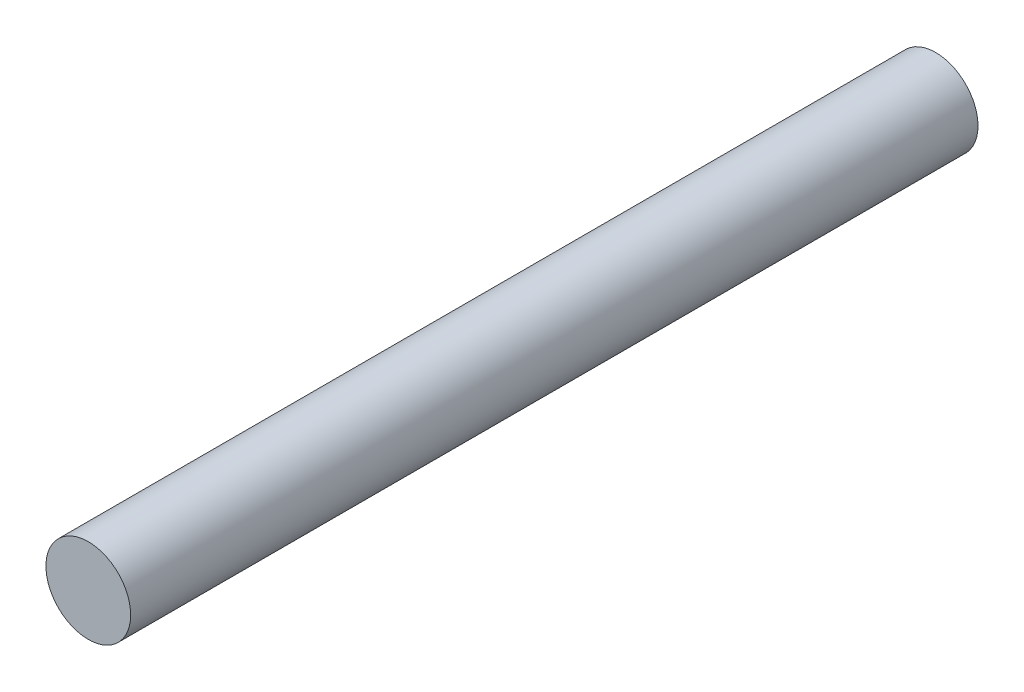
from build123d import *

# Parameters (mm, degrees)
AUFSATZ_LIN_GK_START = -500
PROFIL_R             = 50
AUFSATZ_LIN_GK_DEPTH = 1000


with BuildPart() as part:
    # Profil → Aufsatz-Lin_GK (new body)
    with BuildSketch(Plane.XY.offset(AUFSATZ_LIN_GK_START)):
        Circle(PROFIL_R)
    extrude(amount=AUFSATZ_LIN_GK_DEPTH)


solid = part.part
